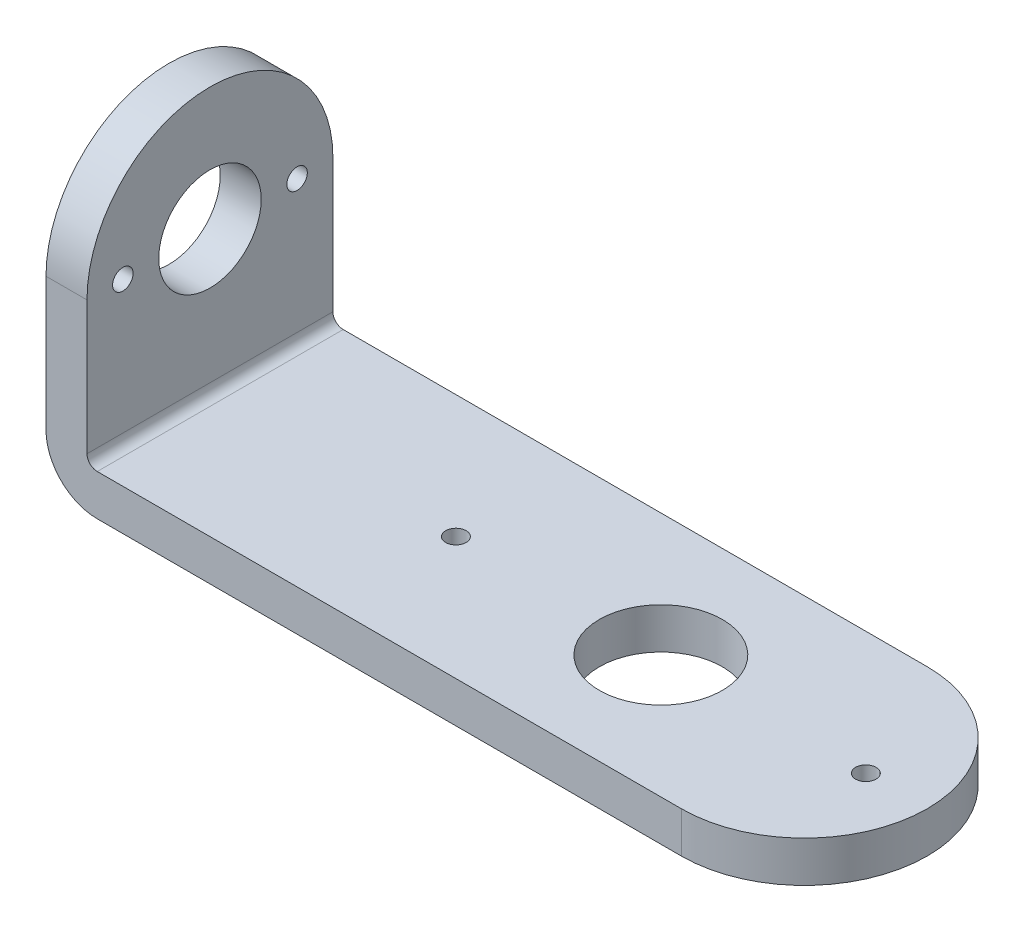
ISO-10303-21;
HEADER;
FILE_DESCRIPTION(('STEP AP214'),'2;1');
FILE_NAME('part.step','',(''),(''),'','','');
FILE_SCHEMA(('AUTOMOTIVE_DESIGN { 1 0 10303 214 1 1 1 1 }'));
ENDSEC;
DATA;
#1=APPLICATION_CONTEXT('core data for automotive mechanical design processes');
#2=APPLICATION_PROTOCOL_DEFINITION('international standard','automotive_design',2000,#1);
#3=PRODUCT_CONTEXT('',#1,'mechanical');
#4=PRODUCT('Part','Part','',(#3));
#5=PRODUCT_RELATED_PRODUCT_CATEGORY('part','',(#4));
#6=PRODUCT_DEFINITION_FORMATION('','',#4);
#7=PRODUCT_DEFINITION_CONTEXT('part definition',#1,'design');
#8=PRODUCT_DEFINITION('design','',#6,#7);
#9=PRODUCT_DEFINITION_SHAPE('','',#8);
#10=(LENGTH_UNIT() NAMED_UNIT(*) SI_UNIT(.MILLI.,.METRE.));
#11=(NAMED_UNIT(*) PLANE_ANGLE_UNIT() SI_UNIT($,.RADIAN.));
#12=(NAMED_UNIT(*) SI_UNIT($,.STERADIAN.) SOLID_ANGLE_UNIT());
#13=UNCERTAINTY_MEASURE_WITH_UNIT(LENGTH_MEASURE(1.E-05),#10,'distance_accuracy_value','');
#14=(GEOMETRIC_REPRESENTATION_CONTEXT(3) GLOBAL_UNCERTAINTY_ASSIGNED_CONTEXT((#13)) GLOBAL_UNIT_ASSIGNED_CONTEXT((#10,
#11,#12)) REPRESENTATION_CONTEXT('',''));
#15=CARTESIAN_POINT('',(0.,0.,0.));
#16=DIRECTION('',(0.,0.,1.));
#17=DIRECTION('',(1.,0.,0.));
#18=AXIS2_PLACEMENT_3D('',#15,#16,#17);
#19=CARTESIAN_POINT('',(-35.,0.499999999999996,6.));
#20=DIRECTION('',(-1.,0.,0.));
#21=DIRECTION('',(0.,0.,1.));
#22=AXIS2_PLACEMENT_3D('',#19,#20,#21);
#23=PLANE('',#22);
#24=CARTESIAN_POINT('',(-35.,7.,-4.25));
#25=DIRECTION('',(1.,0.,0.));
#26=DIRECTION('',(0.,0.,-1.));
#27=AXIS2_PLACEMENT_3D('',#24,#25,#26);
#28=CIRCLE('',#27,0.500000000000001);
#29=CARTESIAN_POINT('',(-35.,7.,-4.75));
#30=VERTEX_POINT('',#29);
#31=EDGE_CURVE('E192',#30,#30,#28,.T.);
#32=ORIENTED_EDGE('',*,*,#31,.F.);
#33=EDGE_LOOP('',(#32));
#34=FACE_BOUND('',#33,.T.);
#35=CARTESIAN_POINT('',(-35.,7.,4.25));
#36=DIRECTION('',(1.,0.,0.));
#37=DIRECTION('',(0.,0.,-1.));
#38=AXIS2_PLACEMENT_3D('',#35,#36,#37);
#39=CIRCLE('',#38,0.5);
#40=CARTESIAN_POINT('',(-35.,7.,3.75));
#41=VERTEX_POINT('',#40);
#42=EDGE_CURVE('E186',#41,#41,#39,.T.);
#43=ORIENTED_EDGE('',*,*,#42,.F.);
#44=EDGE_LOOP('',(#43));
#45=FACE_BOUND('',#44,.T.);
#46=CARTESIAN_POINT('',(-35.,7.,0.));
#47=DIRECTION('',(1.,0.,0.));
#48=DIRECTION('',(0.,0.,-1.));
#49=AXIS2_PLACEMENT_3D('',#46,#47,#48);
#50=CIRCLE('',#49,2.5);
#51=CARTESIAN_POINT('',(-35.,7.,-2.5));
#52=VERTEX_POINT('',#51);
#53=EDGE_CURVE('E175',#52,#52,#50,.T.);
#54=ORIENTED_EDGE('',*,*,#53,.F.);
#55=EDGE_LOOP('',(#54));
#56=FACE_BOUND('',#55,.T.);
#57=DIRECTION('',(0.,1.,0.));
#58=VECTOR('',#57,1.);
#59=CARTESIAN_POINT('',(-35.,0.499999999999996,-6.));
#60=LINE('',#59,#58);
#61=CARTESIAN_POINT('',(-35.,0.499999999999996,-6.));
#62=VERTEX_POINT('',#61);
#63=CARTESIAN_POINT('',(-35.,7.,-6.));
#64=VERTEX_POINT('',#63);
#65=EDGE_CURVE('E144',#62,#64,#60,.T.);
#66=ORIENTED_EDGE('',*,*,#65,.T.);
#67=CARTESIAN_POINT('',(-35.,7.,0.));
#68=DIRECTION('',(-1.,0.,0.));
#69=DIRECTION('',(0.,0.,1.));
#70=AXIS2_PLACEMENT_3D('',#67,#68,#69);
#71=CIRCLE('',#70,6.);
#72=CARTESIAN_POINT('',(-35.,7.,6.));
#73=VERTEX_POINT('',#72);
#74=EDGE_CURVE('E53',#73,#64,#71,.T.);
#75=ORIENTED_EDGE('',*,*,#74,.F.);
#76=DIRECTION('',(0.,1.,0.));
#77=VECTOR('',#76,1.);
#78=CARTESIAN_POINT('',(-35.,0.499999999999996,6.));
#79=LINE('',#78,#77);
#80=CARTESIAN_POINT('',(-35.,0.499999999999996,6.));
#81=VERTEX_POINT('',#80);
#82=EDGE_CURVE('E151',#81,#73,#79,.T.);
#83=ORIENTED_EDGE('',*,*,#82,.F.);
#84=DIRECTION('',(0.,0.,-1.));
#85=VECTOR('',#84,1.);
#86=CARTESIAN_POINT('',(-35.,0.499999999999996,6.));
#87=LINE('',#86,#85);
#88=EDGE_CURVE('E116',#81,#62,#87,.T.);
#89=ORIENTED_EDGE('',*,*,#88,.T.);
#90=EDGE_LOOP('',(#66,#75,#83,#89));
#91=FACE_BOUND('',#90,.T.);
#92=ADVANCED_FACE('F31',(#34,#45,#56,#91),#23,.F.);
#93=CARTESIAN_POINT('',(-37.,0.499999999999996,6.));
#94=DIRECTION('',(-1.,0.,0.));
#95=DIRECTION('',(0.,0.,1.));
#96=AXIS2_PLACEMENT_3D('',#93,#94,#95);
#97=PLANE('',#96);
#98=CARTESIAN_POINT('',(-37.,7.,-4.25));
#99=DIRECTION('',(1.,0.,0.));
#100=DIRECTION('',(0.,0.,-1.));
#101=AXIS2_PLACEMENT_3D('',#98,#99,#100);
#102=CIRCLE('',#101,0.500000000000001);
#103=CARTESIAN_POINT('',(-37.,7.,-4.75));
#104=VERTEX_POINT('',#103);
#105=EDGE_CURVE('E189',#104,#104,#102,.T.);
#106=ORIENTED_EDGE('',*,*,#105,.T.);
#107=EDGE_LOOP('',(#106));
#108=FACE_BOUND('',#107,.T.);
#109=CARTESIAN_POINT('',(-37.,7.,4.25));
#110=DIRECTION('',(1.,0.,0.));
#111=DIRECTION('',(0.,0.,-1.));
#112=AXIS2_PLACEMENT_3D('',#109,#110,#111);
#113=CIRCLE('',#112,0.5);
#114=CARTESIAN_POINT('',(-37.,7.,3.75));
#115=VERTEX_POINT('',#114);
#116=EDGE_CURVE('E183',#115,#115,#113,.T.);
#117=ORIENTED_EDGE('',*,*,#116,.T.);
#118=EDGE_LOOP('',(#117));
#119=FACE_BOUND('',#118,.T.);
#120=CARTESIAN_POINT('',(-37.,7.,0.));
#121=DIRECTION('',(-1.,0.,0.));
#122=DIRECTION('',(0.,0.,1.));
#123=AXIS2_PLACEMENT_3D('',#120,#121,#122);
#124=CIRCLE('',#123,6.);
#125=CARTESIAN_POINT('',(-37.,7.,6.));
#126=VERTEX_POINT('',#125);
#127=CARTESIAN_POINT('',(-37.,7.,-6.));
#128=VERTEX_POINT('',#127);
#129=EDGE_CURVE('E163',#126,#128,#124,.T.);
#130=ORIENTED_EDGE('',*,*,#129,.T.);
#131=DIRECTION('',(0.,1.,0.));
#132=VECTOR('',#131,1.);
#133=CARTESIAN_POINT('',(-37.,0.499999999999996,-6.));
#134=LINE('',#133,#132);
#135=CARTESIAN_POINT('',(-37.,0.499999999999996,-6.));
#136=VERTEX_POINT('',#135);
#137=EDGE_CURVE('E140',#136,#128,#134,.T.);
#138=ORIENTED_EDGE('',*,*,#137,.F.);
#139=DIRECTION('',(0.,0.,-1.));
#140=VECTOR('',#139,1.);
#141=CARTESIAN_POINT('',(-37.,0.499999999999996,6.));
#142=LINE('',#141,#140);
#143=CARTESIAN_POINT('',(-37.,0.499999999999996,6.));
#144=VERTEX_POINT('',#143);
#145=EDGE_CURVE('E11',#144,#136,#142,.T.);
#146=ORIENTED_EDGE('',*,*,#145,.F.);
#147=DIRECTION('',(0.,1.,0.));
#148=VECTOR('',#147,1.);
#149=CARTESIAN_POINT('',(-37.,0.499999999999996,6.));
#150=LINE('',#149,#148);
#151=EDGE_CURVE('E154',#144,#126,#150,.T.);
#152=ORIENTED_EDGE('',*,*,#151,.T.);
#153=EDGE_LOOP('',(#130,#138,#146,#152));
#154=FACE_BOUND('',#153,.T.);
#155=CARTESIAN_POINT('',(-37.,7.,0.));
#156=DIRECTION('',(1.,0.,0.));
#157=DIRECTION('',(0.,0.,-1.));
#158=AXIS2_PLACEMENT_3D('',#155,#156,#157);
#159=CIRCLE('',#158,2.5);
#160=CARTESIAN_POINT('',(-37.,7.,-2.5));
#161=VERTEX_POINT('',#160);
#162=EDGE_CURVE('E173',#161,#161,#159,.T.);
#163=ORIENTED_EDGE('',*,*,#162,.T.);
#164=EDGE_LOOP('',(#163));
#165=FACE_BOUND('',#164,.T.);
#166=ADVANCED_FACE('F161',(#108,#119,#154,#165),#97,.T.);
#167=CARTESIAN_POINT('',(-34.5,0.499999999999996,6.));
#168=DIRECTION('',(0.,0.,-1.));
#169=DIRECTION('',(-1.,0.,0.));
#170=AXIS2_PLACEMENT_3D('',#167,#168,#169);
#171=CYLINDRICAL_SURFACE('',#170,2.5);
#172=CARTESIAN_POINT('',(-34.5,0.499999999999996,-6.));
#173=DIRECTION('',(0.,0.,1.));
#174=DIRECTION('',(1.,0.,0.));
#175=AXIS2_PLACEMENT_3D('',#172,#173,#174);
#176=CIRCLE('',#175,2.5);
#177=CARTESIAN_POINT('',(-34.5,-2.,-6.));
#178=VERTEX_POINT('',#177);
#179=EDGE_CURVE('E135',#178,#136,#176,.F.);
#180=ORIENTED_EDGE('',*,*,#179,.F.);
#181=DIRECTION('',(0.,0.,-1.));
#182=VECTOR('',#181,1.);
#183=CARTESIAN_POINT('',(-34.5,-2.,6.));
#184=LINE('',#183,#182);
#185=CARTESIAN_POINT('',(-34.5,-2.,6.));
#186=VERTEX_POINT('',#185);
#187=EDGE_CURVE('E38',#186,#178,#184,.T.);
#188=ORIENTED_EDGE('',*,*,#187,.F.);
#189=CARTESIAN_POINT('',(-34.5,0.499999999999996,6.));
#190=DIRECTION('',(0.,0.,1.));
#191=DIRECTION('',(1.,0.,0.));
#192=AXIS2_PLACEMENT_3D('',#189,#190,#191);
#193=CIRCLE('',#192,2.5);
#194=EDGE_CURVE('E118',#186,#144,#193,.F.);
#195=ORIENTED_EDGE('',*,*,#194,.T.);
#196=ORIENTED_EDGE('',*,*,#145,.T.);
#197=EDGE_LOOP('',(#180,#188,#195,#196));
#198=FACE_BOUND('',#197,.T.);
#199=ADVANCED_FACE('F136',(#198),#171,.T.);
#200=CARTESIAN_POINT('',(0.,-2.,6.));
#201=DIRECTION('',(0.,-1.,0.));
#202=DIRECTION('',(1.,0.,0.));
#203=AXIS2_PLACEMENT_3D('',#200,#201,#202);
#204=PLANE('',#203);
#205=CARTESIAN_POINT('',(-13.,-2.00000000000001,0.));
#206=DIRECTION('',(0.,1.,0.));
#207=DIRECTION('',(-1.,0.,0.));
#208=AXIS2_PLACEMENT_3D('',#205,#206,#207);
#209=CIRCLE('',#208,3.00000000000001);
#210=CARTESIAN_POINT('',(-16.,-2.00000000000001,0.));
#211=VERTEX_POINT('',#210);
#212=EDGE_CURVE('E100',#211,#211,#209,.T.);
#213=ORIENTED_EDGE('',*,*,#212,.T.);
#214=EDGE_LOOP('',(#213));
#215=FACE_BOUND('',#214,.T.);
#216=DIRECTION('',(-1.,0.,0.));
#217=VECTOR('',#216,1.);
#218=CARTESIAN_POINT('',(0.,-2.,-6.));
#219=LINE('',#218,#217);
#220=CARTESIAN_POINT('',(-6.,-2.,-6.));
#221=VERTEX_POINT('',#220);
#222=EDGE_CURVE('E131',#221,#178,#219,.T.);
#223=ORIENTED_EDGE('',*,*,#222,.F.);
#224=CARTESIAN_POINT('',(-6.,-2.00000000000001,0.));
#225=DIRECTION('',(0.,-1.,0.));
#226=DIRECTION('',(-1.,0.,0.));
#227=AXIS2_PLACEMENT_3D('',#224,#225,#226);
#228=CIRCLE('',#227,6.);
#229=CARTESIAN_POINT('',(-6.,-2.00000000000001,6.));
#230=VERTEX_POINT('',#229);
#231=EDGE_CURVE('E45',#221,#230,#228,.T.);
#232=ORIENTED_EDGE('',*,*,#231,.T.);
#233=DIRECTION('',(-1.,0.,0.));
#234=VECTOR('',#233,1.);
#235=CARTESIAN_POINT('',(0.,-2.,6.));
#236=LINE('',#235,#234);
#237=EDGE_CURVE('E108',#230,#186,#236,.T.);
#238=ORIENTED_EDGE('',*,*,#237,.T.);
#239=ORIENTED_EDGE('',*,*,#187,.T.);
#240=EDGE_LOOP('',(#223,#232,#238,#239));
#241=FACE_BOUND('',#240,.T.);
#242=CARTESIAN_POINT('',(-3.,-2.00000000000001,0.));
#243=DIRECTION('',(0.,1.,0.));
#244=DIRECTION('',(-1.,0.,0.));
#245=AXIS2_PLACEMENT_3D('',#242,#243,#244);
#246=CIRCLE('',#245,0.499999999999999);
#247=CARTESIAN_POINT('',(-3.5,-2.00000000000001,0.));
#248=VERTEX_POINT('',#247);
#249=EDGE_CURVE('E201',#248,#248,#246,.T.);
#250=ORIENTED_EDGE('',*,*,#249,.T.);
#251=EDGE_LOOP('',(#250));
#252=FACE_BOUND('',#251,.T.);
#253=CARTESIAN_POINT('',(-23.,-2.00000000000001,0.));
#254=DIRECTION('',(0.,1.,0.));
#255=DIRECTION('',(-1.,0.,0.));
#256=AXIS2_PLACEMENT_3D('',#253,#254,#255);
#257=CIRCLE('',#256,0.499999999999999);
#258=CARTESIAN_POINT('',(-23.5,-2.00000000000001,0.));
#259=VERTEX_POINT('',#258);
#260=EDGE_CURVE('E195',#259,#259,#257,.T.);
#261=ORIENTED_EDGE('',*,*,#260,.T.);
#262=EDGE_LOOP('',(#261));
#263=FACE_BOUND('',#262,.T.);
#264=ADVANCED_FACE('F129',(#215,#241,#252,#263),#204,.T.);
#265=CARTESIAN_POINT('',(0.,0.,6.));
#266=DIRECTION('',(0.,-1.,0.));
#267=DIRECTION('',(1.,0.,0.));
#268=AXIS2_PLACEMENT_3D('',#265,#266,#267);
#269=PLANE('',#268);
#270=CARTESIAN_POINT('',(-13.,0.,0.));
#271=DIRECTION('',(0.,1.,0.));
#272=DIRECTION('',(-1.,0.,0.));
#273=AXIS2_PLACEMENT_3D('',#270,#271,#272);
#274=CIRCLE('',#273,3.00000000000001);
#275=CARTESIAN_POINT('',(-16.,0.,0.));
#276=VERTEX_POINT('',#275);
#277=EDGE_CURVE('E211',#276,#276,#274,.T.);
#278=ORIENTED_EDGE('',*,*,#277,.F.);
#279=EDGE_LOOP('',(#278));
#280=FACE_BOUND('',#279,.T.);
#281=CARTESIAN_POINT('',(-3.,0.,0.));
#282=DIRECTION('',(0.,1.,0.));
#283=DIRECTION('',(-1.,0.,0.));
#284=AXIS2_PLACEMENT_3D('',#281,#282,#283);
#285=CIRCLE('',#284,0.499999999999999);
#286=CARTESIAN_POINT('',(-3.5,0.,0.));
#287=VERTEX_POINT('',#286);
#288=EDGE_CURVE('E204',#287,#287,#285,.T.);
#289=ORIENTED_EDGE('',*,*,#288,.F.);
#290=EDGE_LOOP('',(#289));
#291=FACE_BOUND('',#290,.T.);
#292=CARTESIAN_POINT('',(-23.,0.,0.));
#293=DIRECTION('',(0.,1.,0.));
#294=DIRECTION('',(-1.,0.,0.));
#295=AXIS2_PLACEMENT_3D('',#292,#293,#294);
#296=CIRCLE('',#295,0.499999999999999);
#297=CARTESIAN_POINT('',(-23.5,0.,0.));
#298=VERTEX_POINT('',#297);
#299=EDGE_CURVE('E198',#298,#298,#296,.T.);
#300=ORIENTED_EDGE('',*,*,#299,.F.);
#301=EDGE_LOOP('',(#300));
#302=FACE_BOUND('',#301,.T.);
#303=CARTESIAN_POINT('',(-6.,0.,0.));
#304=DIRECTION('',(0.,-1.,0.));
#305=DIRECTION('',(-1.,0.,0.));
#306=AXIS2_PLACEMENT_3D('',#303,#304,#305);
#307=CIRCLE('',#306,6.);
#308=CARTESIAN_POINT('',(-6.,0.,-6.));
#309=VERTEX_POINT('',#308);
#310=CARTESIAN_POINT('',(-6.,0.,6.));
#311=VERTEX_POINT('',#310);
#312=EDGE_CURVE('E92',#309,#311,#307,.T.);
#313=ORIENTED_EDGE('',*,*,#312,.F.);
#314=DIRECTION('',(-1.,0.,0.));
#315=VECTOR('',#314,1.);
#316=CARTESIAN_POINT('',(0.,0.,-6.));
#317=LINE('',#316,#315);
#318=CARTESIAN_POINT('',(-34.5,0.,-6.));
#319=VERTEX_POINT('',#318);
#320=EDGE_CURVE('E142',#309,#319,#317,.T.);
#321=ORIENTED_EDGE('',*,*,#320,.T.);
#322=DIRECTION('',(0.,0.,-1.));
#323=VECTOR('',#322,1.);
#324=CARTESIAN_POINT('',(-34.5,0.,6.));
#325=LINE('',#324,#323);
#326=CARTESIAN_POINT('',(-34.5,0.,6.));
#327=VERTEX_POINT('',#326);
#328=EDGE_CURVE('E112',#327,#319,#325,.T.);
#329=ORIENTED_EDGE('',*,*,#328,.F.);
#330=DIRECTION('',(-1.,0.,0.));
#331=VECTOR('',#330,1.);
#332=CARTESIAN_POINT('',(0.,0.,6.));
#333=LINE('',#332,#331);
#334=EDGE_CURVE('E105',#311,#327,#333,.T.);
#335=ORIENTED_EDGE('',*,*,#334,.F.);
#336=EDGE_LOOP('',(#313,#321,#329,#335));
#337=FACE_BOUND('',#336,.T.);
#338=ADVANCED_FACE('F110',(#280,#291,#302,#337),#269,.F.);
#339=CARTESIAN_POINT('',(-34.5,0.499999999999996,6.));
#340=DIRECTION('',(0.,0.,-1.));
#341=DIRECTION('',(-1.,0.,0.));
#342=AXIS2_PLACEMENT_3D('',#339,#340,#341);
#343=CYLINDRICAL_SURFACE('',#342,0.5);
#344=CARTESIAN_POINT('',(-34.5,0.499999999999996,-6.));
#345=DIRECTION('',(0.,0.,-1.));
#346=DIRECTION('',(-1.,0.,0.));
#347=AXIS2_PLACEMENT_3D('',#344,#345,#346);
#348=CIRCLE('',#347,0.5);
#349=EDGE_CURVE('E149',#319,#62,#348,.T.);
#350=ORIENTED_EDGE('',*,*,#349,.T.);
#351=ORIENTED_EDGE('',*,*,#88,.F.);
#352=CARTESIAN_POINT('',(-34.5,0.499999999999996,6.));
#353=DIRECTION('',(0.,0.,-1.));
#354=DIRECTION('',(-1.,0.,0.));
#355=AXIS2_PLACEMENT_3D('',#352,#353,#354);
#356=CIRCLE('',#355,0.5);
#357=EDGE_CURVE('E114',#327,#81,#356,.T.);
#358=ORIENTED_EDGE('',*,*,#357,.F.);
#359=ORIENTED_EDGE('',*,*,#328,.T.);
#360=EDGE_LOOP('',(#350,#351,#358,#359));
#361=FACE_BOUND('',#360,.T.);
#362=ADVANCED_FACE('F219',(#361),#343,.F.);
#363=CARTESIAN_POINT('',(-34.5,0.499999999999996,6.));
#364=DIRECTION('',(0.,0.,1.));
#365=DIRECTION('',(1.,0.,0.));
#366=AXIS2_PLACEMENT_3D('',#363,#364,#365);
#367=PLANE('',#366);
#368=DIRECTION('',(0.,1.,0.));
#369=VECTOR('',#368,1.);
#370=CARTESIAN_POINT('',(-6.,-2.00000000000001,6.));
#371=LINE('',#370,#369);
#372=EDGE_CURVE('E95',#230,#311,#371,.T.);
#373=ORIENTED_EDGE('',*,*,#372,.T.);
#374=ORIENTED_EDGE('',*,*,#334,.T.);
#375=ORIENTED_EDGE('',*,*,#357,.T.);
#376=ORIENTED_EDGE('',*,*,#82,.T.);
#377=DIRECTION('',(1.,0.,0.));
#378=VECTOR('',#377,1.);
#379=CARTESIAN_POINT('',(-37.,7.,6.));
#380=LINE('',#379,#378);
#381=EDGE_CURVE('E158',#126,#73,#380,.T.);
#382=ORIENTED_EDGE('',*,*,#381,.F.);
#383=ORIENTED_EDGE('',*,*,#151,.F.);
#384=ORIENTED_EDGE('',*,*,#194,.F.);
#385=ORIENTED_EDGE('',*,*,#237,.F.);
#386=EDGE_LOOP('',(#373,#374,#375,#376,#382,#383,#384,#385));
#387=FACE_BOUND('',#386,.T.);
#388=ADVANCED_FACE('F104',(#387),#367,.T.);
#389=CARTESIAN_POINT('',(-34.5,0.499999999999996,-6.));
#390=DIRECTION('',(0.,0.,1.));
#391=DIRECTION('',(1.,0.,0.));
#392=AXIS2_PLACEMENT_3D('',#389,#390,#391);
#393=PLANE('',#392);
#394=ORIENTED_EDGE('',*,*,#320,.F.);
#395=DIRECTION('',(0.,1.,0.));
#396=VECTOR('',#395,1.);
#397=CARTESIAN_POINT('',(-6.,-2.00000000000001,-6.));
#398=LINE('',#397,#396);
#399=EDGE_CURVE('E96',#221,#309,#398,.T.);
#400=ORIENTED_EDGE('',*,*,#399,.F.);
#401=ORIENTED_EDGE('',*,*,#222,.T.);
#402=ORIENTED_EDGE('',*,*,#179,.T.);
#403=ORIENTED_EDGE('',*,*,#137,.T.);
#404=DIRECTION('',(1.,0.,0.));
#405=VECTOR('',#404,1.);
#406=CARTESIAN_POINT('',(-37.,7.,-6.));
#407=LINE('',#406,#405);
#408=EDGE_CURVE('E166',#128,#64,#407,.T.);
#409=ORIENTED_EDGE('',*,*,#408,.T.);
#410=ORIENTED_EDGE('',*,*,#65,.F.);
#411=ORIENTED_EDGE('',*,*,#349,.F.);
#412=EDGE_LOOP('',(#394,#400,#401,#402,#403,#409,#410,#411));
#413=FACE_BOUND('',#412,.T.);
#414=ADVANCED_FACE('F164',(#413),#393,.F.);
#415=CARTESIAN_POINT('',(-37.,7.,0.));
#416=DIRECTION('',(1.,0.,0.));
#417=DIRECTION('',(0.,0.,-1.));
#418=AXIS2_PLACEMENT_3D('',#415,#416,#417);
#419=CYLINDRICAL_SURFACE('',#418,2.5);
#420=ORIENTED_EDGE('',*,*,#162,.F.);
#421=EDGE_LOOP('',(#420));
#422=FACE_BOUND('',#421,.T.);
#423=ORIENTED_EDGE('',*,*,#53,.T.);
#424=EDGE_LOOP('',(#423));
#425=FACE_BOUND('',#424,.T.);
#426=ADVANCED_FACE('F253',(#422,#425),#419,.F.);
#427=CARTESIAN_POINT('',(-37.,7.,0.));
#428=DIRECTION('',(1.,0.,0.));
#429=DIRECTION('',(0.,0.,-1.));
#430=AXIS2_PLACEMENT_3D('',#427,#428,#429);
#431=CYLINDRICAL_SURFACE('',#430,6.);
#432=ORIENTED_EDGE('',*,*,#74,.T.);
#433=ORIENTED_EDGE('',*,*,#408,.F.);
#434=ORIENTED_EDGE('',*,*,#129,.F.);
#435=ORIENTED_EDGE('',*,*,#381,.T.);
#436=EDGE_LOOP('',(#432,#433,#434,#435));
#437=FACE_BOUND('',#436,.T.);
#438=ADVANCED_FACE('F255',(#437),#431,.T.);
#439=CARTESIAN_POINT('',(-37.,7.,4.25));
#440=DIRECTION('',(1.,0.,0.));
#441=DIRECTION('',(0.,0.,-1.));
#442=AXIS2_PLACEMENT_3D('',#439,#440,#441);
#443=CYLINDRICAL_SURFACE('',#442,0.5);
#444=ORIENTED_EDGE('',*,*,#116,.F.);
#445=EDGE_LOOP('',(#444));
#446=FACE_BOUND('',#445,.T.);
#447=ORIENTED_EDGE('',*,*,#42,.T.);
#448=EDGE_LOOP('',(#447));
#449=FACE_BOUND('',#448,.T.);
#450=ADVANCED_FACE('F237',(#446,#449),#443,.F.);
#451=CARTESIAN_POINT('',(-37.,7.,-4.25));
#452=DIRECTION('',(1.,0.,0.));
#453=DIRECTION('',(0.,0.,-1.));
#454=AXIS2_PLACEMENT_3D('',#451,#452,#453);
#455=CYLINDRICAL_SURFACE('',#454,0.500000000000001);
#456=ORIENTED_EDGE('',*,*,#105,.F.);
#457=EDGE_LOOP('',(#456));
#458=FACE_BOUND('',#457,.T.);
#459=ORIENTED_EDGE('',*,*,#31,.T.);
#460=EDGE_LOOP('',(#459));
#461=FACE_BOUND('',#460,.T.);
#462=ADVANCED_FACE('F228',(#458,#461),#455,.F.);
#463=CARTESIAN_POINT('',(-23.,-2.00000000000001,0.));
#464=DIRECTION('',(0.,1.,0.));
#465=DIRECTION('',(-1.,0.,0.));
#466=AXIS2_PLACEMENT_3D('',#463,#464,#465);
#467=CYLINDRICAL_SURFACE('',#466,0.499999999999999);
#468=ORIENTED_EDGE('',*,*,#260,.F.);
#469=EDGE_LOOP('',(#468));
#470=FACE_BOUND('',#469,.T.);
#471=ORIENTED_EDGE('',*,*,#299,.T.);
#472=EDGE_LOOP('',(#471));
#473=FACE_BOUND('',#472,.T.);
#474=ADVANCED_FACE('F225',(#470,#473),#467,.F.);
#475=CARTESIAN_POINT('',(-3.,-2.00000000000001,0.));
#476=DIRECTION('',(0.,1.,0.));
#477=DIRECTION('',(-1.,0.,0.));
#478=AXIS2_PLACEMENT_3D('',#475,#476,#477);
#479=CYLINDRICAL_SURFACE('',#478,0.499999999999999);
#480=ORIENTED_EDGE('',*,*,#249,.F.);
#481=EDGE_LOOP('',(#480));
#482=FACE_BOUND('',#481,.T.);
#483=ORIENTED_EDGE('',*,*,#288,.T.);
#484=EDGE_LOOP('',(#483));
#485=FACE_BOUND('',#484,.T.);
#486=ADVANCED_FACE('F227',(#482,#485),#479,.F.);
#487=CARTESIAN_POINT('',(-6.,-2.00000000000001,0.));
#488=DIRECTION('',(0.,1.,0.));
#489=DIRECTION('',(-1.,0.,0.));
#490=AXIS2_PLACEMENT_3D('',#487,#488,#489);
#491=CYLINDRICAL_SURFACE('',#490,6.);
#492=ORIENTED_EDGE('',*,*,#312,.T.);
#493=ORIENTED_EDGE('',*,*,#372,.F.);
#494=ORIENTED_EDGE('',*,*,#231,.F.);
#495=ORIENTED_EDGE('',*,*,#399,.T.);
#496=EDGE_LOOP('',(#492,#493,#494,#495));
#497=FACE_BOUND('',#496,.T.);
#498=ADVANCED_FACE('F94',(#497),#491,.T.);
#499=CARTESIAN_POINT('',(-13.,-2.00000000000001,0.));
#500=DIRECTION('',(0.,1.,0.));
#501=DIRECTION('',(-1.,0.,0.));
#502=AXIS2_PLACEMENT_3D('',#499,#500,#501);
#503=CYLINDRICAL_SURFACE('',#502,3.00000000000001);
#504=ORIENTED_EDGE('',*,*,#212,.F.);
#505=EDGE_LOOP('',(#504));
#506=FACE_BOUND('',#505,.T.);
#507=ORIENTED_EDGE('',*,*,#277,.T.);
#508=EDGE_LOOP('',(#507));
#509=FACE_BOUND('',#508,.T.);
#510=ADVANCED_FACE('F215',(#506,#509),#503,.F.);
#511=CLOSED_SHELL('',(#92,#166,#199,#264,#338,#362,#388,#414,#426,#438,#450,#462,#474,#486,#498,#510));
#512=MANIFOLD_SOLID_BREP('B2',#511);
#513=ADVANCED_BREP_SHAPE_REPRESENTATION('',(#18,#512),#14);
#514=SHAPE_DEFINITION_REPRESENTATION(#9,#513);
ENDSEC;
END-ISO-10303-21;
